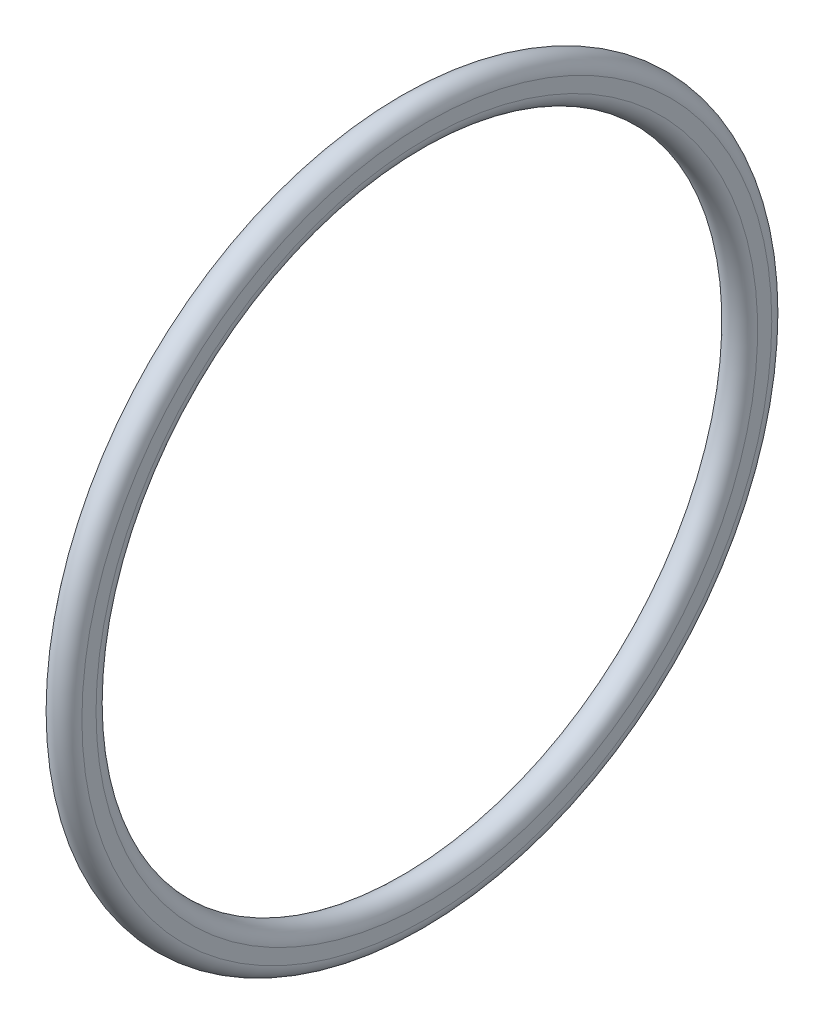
from build123d import *


with BuildPart() as part:
    # Sketch1 → Revolve1 (revolve)
    with BuildSketch(Plane.XY, mode=Mode.PRIVATE) as revolve1_sk:
        with BuildLine():
            Line((-1.3335, 31.0007), (-1.3335, 29.7307))
            ThreePointArc((-1.3335, 29.7307), (0, 28.3972), (1.3335, 29.7307))
            Line((1.3335, 29.7307), (1.3335, 31.0007))
            ThreePointArc((1.3335, 31.0007), (0, 32.3342), (-1.3335, 31.0007))
        make_face()
    revolve(revolve1_sk.sketch.rotate(Axis((0, 0, 0), (1, 0, 0)), 90), axis=Axis((0, 0, 0), (1, 0, 0)))


solid = part.part
